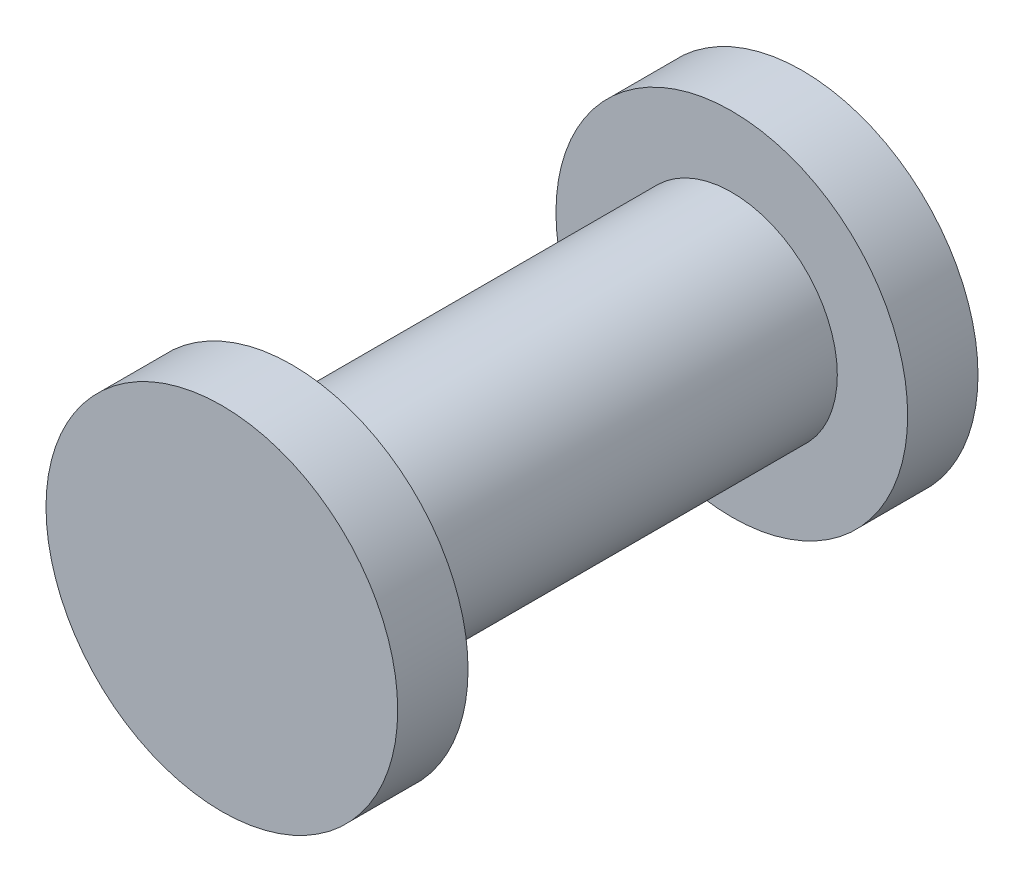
ISO-10303-21;
HEADER;
FILE_DESCRIPTION(('STEP AP214'),'2;1');
FILE_NAME('part.step','',(''),(''),'','','');
FILE_SCHEMA(('AUTOMOTIVE_DESIGN { 1 0 10303 214 1 1 1 1 }'));
ENDSEC;
DATA;
#1=APPLICATION_CONTEXT('core data for automotive mechanical design processes');
#2=APPLICATION_PROTOCOL_DEFINITION('international standard','automotive_design',2000,#1);
#3=PRODUCT_CONTEXT('',#1,'mechanical');
#4=PRODUCT('Part','Part','',(#3));
#5=PRODUCT_RELATED_PRODUCT_CATEGORY('part','',(#4));
#6=PRODUCT_DEFINITION_FORMATION('','',#4);
#7=PRODUCT_DEFINITION_CONTEXT('part definition',#1,'design');
#8=PRODUCT_DEFINITION('design','',#6,#7);
#9=PRODUCT_DEFINITION_SHAPE('','',#8);
#10=(LENGTH_UNIT() NAMED_UNIT(*) SI_UNIT(.MILLI.,.METRE.));
#11=(NAMED_UNIT(*) PLANE_ANGLE_UNIT() SI_UNIT($,.RADIAN.));
#12=(NAMED_UNIT(*) SI_UNIT($,.STERADIAN.) SOLID_ANGLE_UNIT());
#13=UNCERTAINTY_MEASURE_WITH_UNIT(LENGTH_MEASURE(1.E-05),#10,'distance_accuracy_value','');
#14=(GEOMETRIC_REPRESENTATION_CONTEXT(3) GLOBAL_UNCERTAINTY_ASSIGNED_CONTEXT((#13)) GLOBAL_UNIT_ASSIGNED_CONTEXT((#10,
#11,#12)) REPRESENTATION_CONTEXT('',''));
#15=CARTESIAN_POINT('',(0.,0.,0.));
#16=DIRECTION('',(0.,0.,1.));
#17=DIRECTION('',(1.,0.,0.));
#18=AXIS2_PLACEMENT_3D('',#15,#16,#17);
#19=CARTESIAN_POINT('',(0.,0.,-8.25));
#20=DIRECTION('',(0.,0.,1.));
#21=DIRECTION('',(1.,0.,0.));
#22=AXIS2_PLACEMENT_3D('',#19,#20,#21);
#23=CYLINDRICAL_SURFACE('',#22,5.);
#24=CARTESIAN_POINT('',(0.,0.,-8.25));
#25=DIRECTION('',(0.,0.,1.));
#26=DIRECTION('',(1.,0.,0.));
#27=AXIS2_PLACEMENT_3D('',#24,#25,#26);
#28=CIRCLE('',#27,5.);
#29=CARTESIAN_POINT('',(5.,0.,-8.25));
#30=VERTEX_POINT('',#29);
#31=EDGE_CURVE('E10',#30,#30,#28,.T.);
#32=ORIENTED_EDGE('',*,*,#31,.T.);
#33=EDGE_LOOP('',(#32));
#34=FACE_BOUND('',#33,.T.);
#35=CARTESIAN_POINT('',(0.,0.,-6.25));
#36=DIRECTION('',(0.,0.,1.));
#37=DIRECTION('',(1.,0.,0.));
#38=AXIS2_PLACEMENT_3D('',#35,#36,#37);
#39=CIRCLE('',#38,5.);
#40=CARTESIAN_POINT('',(5.,0.,-6.25));
#41=VERTEX_POINT('',#40);
#42=EDGE_CURVE('E43',#41,#41,#39,.F.);
#43=ORIENTED_EDGE('',*,*,#42,.T.);
#44=EDGE_LOOP('',(#43));
#45=FACE_BOUND('',#44,.T.);
#46=ADVANCED_FACE('F39',(#34,#45),#23,.T.);
#47=CARTESIAN_POINT('',(0.,0.,-8.25));
#48=DIRECTION('',(0.,0.,1.));
#49=DIRECTION('',(1.,0.,0.));
#50=AXIS2_PLACEMENT_3D('',#47,#48,#49);
#51=PLANE('',#50);
#52=ORIENTED_EDGE('',*,*,#31,.F.);
#53=EDGE_LOOP('',(#52));
#54=FACE_BOUND('',#53,.T.);
#55=ADVANCED_FACE('F84',(#54),#51,.F.);
#56=CARTESIAN_POINT('',(0.,0.,-6.25));
#57=DIRECTION('',(0.,0.,1.));
#58=DIRECTION('',(1.,0.,0.));
#59=AXIS2_PLACEMENT_3D('',#56,#57,#58);
#60=PLANE('',#59);
#61=ORIENTED_EDGE('',*,*,#42,.F.);
#62=EDGE_LOOP('',(#61));
#63=FACE_BOUND('',#62,.T.);
#64=CARTESIAN_POINT('',(0.,0.,-6.25));
#65=DIRECTION('',(0.,0.,1.));
#66=DIRECTION('',(1.,0.,0.));
#67=AXIS2_PLACEMENT_3D('',#64,#65,#66);
#68=CIRCLE('',#67,3.);
#69=CARTESIAN_POINT('',(3.,0.,-6.25));
#70=VERTEX_POINT('',#69);
#71=EDGE_CURVE('E58',#70,#70,#68,.T.);
#72=ORIENTED_EDGE('',*,*,#71,.F.);
#73=EDGE_LOOP('',(#72));
#74=FACE_BOUND('',#73,.T.);
#75=ADVANCED_FACE('F80',(#63,#74),#60,.T.);
#76=CARTESIAN_POINT('',(0.,0.,6.25));
#77=DIRECTION('',(0.,0.,1.));
#78=DIRECTION('',(1.,0.,0.));
#79=AXIS2_PLACEMENT_3D('',#76,#77,#78);
#80=PLANE('',#79);
#81=CARTESIAN_POINT('',(0.,0.,6.25));
#82=DIRECTION('',(0.,0.,1.));
#83=DIRECTION('',(1.,0.,0.));
#84=AXIS2_PLACEMENT_3D('',#81,#82,#83);
#85=CIRCLE('',#84,5.);
#86=CARTESIAN_POINT('',(5.,0.,6.25));
#87=VERTEX_POINT('',#86);
#88=EDGE_CURVE('E56',#87,#87,#85,.F.);
#89=ORIENTED_EDGE('',*,*,#88,.T.);
#90=EDGE_LOOP('',(#89));
#91=FACE_BOUND('',#90,.T.);
#92=CARTESIAN_POINT('',(0.,0.,6.25));
#93=DIRECTION('',(0.,0.,1.));
#94=DIRECTION('',(1.,0.,0.));
#95=AXIS2_PLACEMENT_3D('',#92,#93,#94);
#96=CIRCLE('',#95,3.);
#97=CARTESIAN_POINT('',(3.,0.,6.25));
#98=VERTEX_POINT('',#97);
#99=EDGE_CURVE('E54',#98,#98,#96,.T.);
#100=ORIENTED_EDGE('',*,*,#99,.T.);
#101=EDGE_LOOP('',(#100));
#102=FACE_BOUND('',#101,.T.);
#103=ADVANCED_FACE('F68',(#91,#102),#80,.F.);
#104=CARTESIAN_POINT('',(0.,0.,-6.25));
#105=DIRECTION('',(0.,0.,1.));
#106=DIRECTION('',(1.,0.,0.));
#107=AXIS2_PLACEMENT_3D('',#104,#105,#106);
#108=CYLINDRICAL_SURFACE('',#107,3.);
#109=ORIENTED_EDGE('',*,*,#71,.T.);
#110=EDGE_LOOP('',(#109));
#111=FACE_BOUND('',#110,.T.);
#112=ORIENTED_EDGE('',*,*,#99,.F.);
#113=EDGE_LOOP('',(#112));
#114=FACE_BOUND('',#113,.T.);
#115=ADVANCED_FACE('F70',(#111,#114),#108,.T.);
#116=CARTESIAN_POINT('',(0.,0.,8.25));
#117=DIRECTION('',(0.,0.,1.));
#118=DIRECTION('',(1.,0.,0.));
#119=AXIS2_PLACEMENT_3D('',#116,#117,#118);
#120=PLANE('',#119);
#121=CARTESIAN_POINT('',(0.,0.,8.25));
#122=DIRECTION('',(0.,0.,1.));
#123=DIRECTION('',(1.,0.,0.));
#124=AXIS2_PLACEMENT_3D('',#121,#122,#123);
#125=CIRCLE('',#124,5.);
#126=CARTESIAN_POINT('',(5.,0.,8.25));
#127=VERTEX_POINT('',#126);
#128=EDGE_CURVE('E47',#127,#127,#125,.T.);
#129=ORIENTED_EDGE('',*,*,#128,.T.);
#130=EDGE_LOOP('',(#129));
#131=FACE_BOUND('',#130,.T.);
#132=ADVANCED_FACE('F72',(#131),#120,.T.);
#133=ORIENTED_EDGE('',*,*,#88,.F.);
#134=EDGE_LOOP('',(#133));
#135=FACE_BOUND('',#134,.T.);
#136=ORIENTED_EDGE('',*,*,#128,.F.);
#137=EDGE_LOOP('',(#136));
#138=FACE_BOUND('',#137,.T.);
#139=ADVANCED_FACE('F41',(#135,#138),#23,.T.);
#140=CLOSED_SHELL('',(#46,#55,#75,#103,#115,#132,#139));
#141=MANIFOLD_SOLID_BREP('B2',#140);
#142=ADVANCED_BREP_SHAPE_REPRESENTATION('',(#18,#141),#14);
#143=SHAPE_DEFINITION_REPRESENTATION(#9,#142);
ENDSEC;
END-ISO-10303-21;
